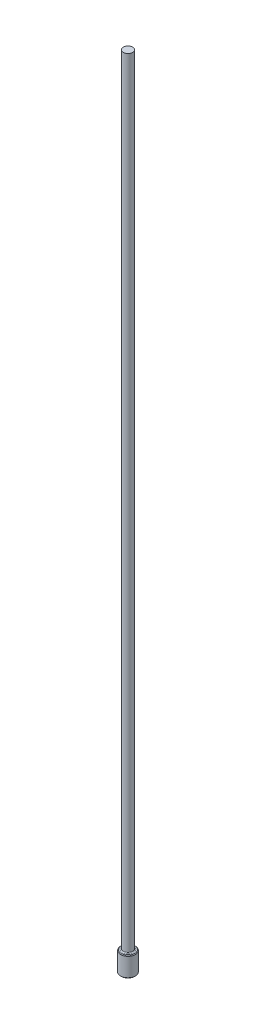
ISO-10303-21;
HEADER;
FILE_DESCRIPTION(('STEP AP214'),'2;1');
FILE_NAME('part.step','',(''),(''),'','','');
FILE_SCHEMA(('AUTOMOTIVE_DESIGN { 1 0 10303 214 1 1 1 1 }'));
ENDSEC;
DATA;
#1=APPLICATION_CONTEXT('core data for automotive mechanical design processes');
#2=APPLICATION_PROTOCOL_DEFINITION('international standard','automotive_design',2000,#1);
#3=PRODUCT_CONTEXT('',#1,'mechanical');
#4=PRODUCT('Part','Part','',(#3));
#5=PRODUCT_RELATED_PRODUCT_CATEGORY('part','',(#4));
#6=PRODUCT_DEFINITION_FORMATION('','',#4);
#7=PRODUCT_DEFINITION_CONTEXT('part definition',#1,'design');
#8=PRODUCT_DEFINITION('design','',#6,#7);
#9=PRODUCT_DEFINITION_SHAPE('','',#8);
#10=(LENGTH_UNIT() NAMED_UNIT(*) SI_UNIT(.MILLI.,.METRE.));
#11=(NAMED_UNIT(*) PLANE_ANGLE_UNIT() SI_UNIT($,.RADIAN.));
#12=(NAMED_UNIT(*) SI_UNIT($,.STERADIAN.) SOLID_ANGLE_UNIT());
#13=UNCERTAINTY_MEASURE_WITH_UNIT(LENGTH_MEASURE(1.E-05),#10,'distance_accuracy_value','');
#14=(GEOMETRIC_REPRESENTATION_CONTEXT(3) GLOBAL_UNCERTAINTY_ASSIGNED_CONTEXT((#13)) GLOBAL_UNIT_ASSIGNED_CONTEXT((#10,
#11,#12)) REPRESENTATION_CONTEXT('',''));
#15=CARTESIAN_POINT('',(0.,0.,0.));
#16=DIRECTION('',(0.,0.,1.));
#17=DIRECTION('',(1.,0.,0.));
#18=AXIS2_PLACEMENT_3D('',#15,#16,#17);
#19=CARTESIAN_POINT('',(0.,0.,0.));
#20=DIRECTION('',(0.,-1.,0.));
#21=DIRECTION('',(0.,0.,-1.));
#22=AXIS2_PLACEMENT_3D('',#19,#20,#21);
#23=PLANE('',#22);
#24=CARTESIAN_POINT('',(0.,0.,0.));
#25=DIRECTION('',(0.,-1.,0.));
#26=DIRECTION('',(0.,0.,-1.));
#27=AXIS2_PLACEMENT_3D('',#24,#25,#26);
#28=CIRCLE('',#27,0.533399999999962);
#29=CARTESIAN_POINT('',(0.,0.,-0.533399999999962));
#30=VERTEX_POINT('',#29);
#31=EDGE_CURVE('E46',#30,#30,#28,.T.);
#32=ORIENTED_EDGE('',*,*,#31,.T.);
#33=EDGE_LOOP('',(#32));
#34=FACE_BOUND('',#33,.T.);
#35=ADVANCED_FACE('F35',(#34),#23,.T.);
#36=CARTESIAN_POINT('',(0.,259.958771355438,0.));
#37=DIRECTION('',(0.,1.,0.));
#38=DIRECTION('',(0.,0.,1.));
#39=AXIS2_PLACEMENT_3D('',#36,#37,#38);
#40=CYLINDRICAL_SURFACE('',#39,0.584199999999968);
#41=CARTESIAN_POINT('',(0.,1.52399999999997,0.));
#42=DIRECTION('',(0.,1.,0.));
#43=DIRECTION('',(0.,0.,1.));
#44=AXIS2_PLACEMENT_3D('',#41,#42,#43);
#45=CIRCLE('',#44,0.584199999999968);
#46=CARTESIAN_POINT('',(0.,1.52399999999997,0.584199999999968));
#47=VERTEX_POINT('',#46);
#48=EDGE_CURVE('E50',#47,#47,#45,.F.);
#49=ORIENTED_EDGE('',*,*,#48,.T.);
#50=EDGE_LOOP('',(#49));
#51=FACE_BOUND('',#50,.T.);
#52=CARTESIAN_POINT('',(0.,0.0508000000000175,0.));
#53=DIRECTION('',(0.,-1.,0.));
#54=DIRECTION('',(0.,0.,-1.));
#55=AXIS2_PLACEMENT_3D('',#52,#53,#54);
#56=CIRCLE('',#55,0.584199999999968);
#57=CARTESIAN_POINT('',(0.,0.0508000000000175,-0.584199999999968));
#58=VERTEX_POINT('',#57);
#59=EDGE_CURVE('E55',#58,#58,#56,.F.);
#60=ORIENTED_EDGE('',*,*,#59,.T.);
#61=EDGE_LOOP('',(#60));
#62=FACE_BOUND('',#61,.T.);
#63=ADVANCED_FACE('F77',(#51,#62),#40,.T.);
#64=CARTESIAN_POINT('',(-0.584199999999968,1.5748,0.));
#65=DIRECTION('',(0.,1.,0.));
#66=DIRECTION('',(0.,0.,1.));
#67=AXIS2_PLACEMENT_3D('',#64,#65,#66);
#68=PLANE('',#67);
#69=CARTESIAN_POINT('',(0.,1.5748,0.));
#70=DIRECTION('',(0.,1.,0.));
#71=DIRECTION('',(0.,0.,1.));
#72=AXIS2_PLACEMENT_3D('',#69,#70,#71);
#73=CIRCLE('',#72,0.444499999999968);
#74=CARTESIAN_POINT('',(0.,1.5748,0.444499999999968));
#75=VERTEX_POINT('',#74);
#76=EDGE_CURVE('E10',#75,#75,#73,.F.);
#77=ORIENTED_EDGE('',*,*,#76,.T.);
#78=EDGE_LOOP('',(#77));
#79=FACE_BOUND('',#78,.T.);
#80=CARTESIAN_POINT('',(0.,1.5748,0.));
#81=DIRECTION('',(0.,1.,0.));
#82=DIRECTION('',(0.,0.,1.));
#83=AXIS2_PLACEMENT_3D('',#80,#81,#82);
#84=CIRCLE('',#83,0.533399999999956);
#85=CARTESIAN_POINT('',(0.,1.5748,0.533399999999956));
#86=VERTEX_POINT('',#85);
#87=EDGE_CURVE('E58',#86,#86,#84,.T.);
#88=ORIENTED_EDGE('',*,*,#87,.T.);
#89=EDGE_LOOP('',(#88));
#90=FACE_BOUND('',#89,.T.);
#91=ADVANCED_FACE('F69',(#79,#90),#68,.T.);
#92=CARTESIAN_POINT('',(0.,259.958771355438,0.));
#93=DIRECTION('',(0.,1.,0.));
#94=DIRECTION('',(0.,0.,1.));
#95=AXIS2_PLACEMENT_3D('',#92,#93,#94);
#96=CYLINDRICAL_SURFACE('',#95,0.368299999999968);
#97=CARTESIAN_POINT('',(0.,1.65100000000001,0.));
#98=DIRECTION('',(0.,1.,0.));
#99=DIRECTION('',(0.,0.,1.));
#100=AXIS2_PLACEMENT_3D('',#97,#98,#99);
#101=CIRCLE('',#100,0.368299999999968);
#102=CARTESIAN_POINT('',(0.,1.65100000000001,0.368299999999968));
#103=VERTEX_POINT('',#102);
#104=EDGE_CURVE('E42',#103,#103,#101,.T.);
#105=ORIENTED_EDGE('',*,*,#104,.T.);
#106=EDGE_LOOP('',(#105));
#107=FACE_BOUND('',#106,.T.);
#108=CARTESIAN_POINT('',(0.,63.5,0.));
#109=DIRECTION('',(0.,1.,0.));
#110=DIRECTION('',(0.,0.,1.));
#111=AXIS2_PLACEMENT_3D('',#108,#109,#110);
#112=CIRCLE('',#111,0.368299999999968);
#113=CARTESIAN_POINT('',(0.,63.5,0.368299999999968));
#114=VERTEX_POINT('',#113);
#115=EDGE_CURVE('E61',#114,#114,#112,.T.);
#116=ORIENTED_EDGE('',*,*,#115,.F.);
#117=EDGE_LOOP('',(#116));
#118=FACE_BOUND('',#117,.T.);
#119=ADVANCED_FACE('F67',(#107,#118),#96,.T.);
#120=CARTESIAN_POINT('',(-0.368299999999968,63.5,0.));
#121=DIRECTION('',(0.,1.,0.));
#122=DIRECTION('',(0.,0.,1.));
#123=AXIS2_PLACEMENT_3D('',#120,#121,#122);
#124=PLANE('',#123);
#125=ORIENTED_EDGE('',*,*,#115,.T.);
#126=EDGE_LOOP('',(#125));
#127=FACE_BOUND('',#126,.T.);
#128=ADVANCED_FACE('F65',(#127),#124,.T.);
#129=CARTESIAN_POINT('',(0.,1.57479999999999,0.));
#130=DIRECTION('',(0.,-1.,0.));
#131=DIRECTION('',(0.,0.,-1.));
#132=AXIS2_PLACEMENT_3D('',#129,#130,#131);
#133=CONICAL_SURFACE('',#132,0.533399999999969,0.785398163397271);
#134=ORIENTED_EDGE('',*,*,#48,.F.);
#135=EDGE_LOOP('',(#134));
#136=FACE_BOUND('',#135,.T.);
#137=ORIENTED_EDGE('',*,*,#87,.F.);
#138=EDGE_LOOP('',(#137));
#139=FACE_BOUND('',#138,.T.);
#140=ADVANCED_FACE('F75',(#136,#139),#133,.T.);
#141=CARTESIAN_POINT('',(0.,0.0508000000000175,0.));
#142=DIRECTION('',(0.,1.,0.));
#143=DIRECTION('',(0.,0.,1.));
#144=AXIS2_PLACEMENT_3D('',#141,#142,#143);
#145=CONICAL_SURFACE('',#144,0.584199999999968,0.785398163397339);
#146=ORIENTED_EDGE('',*,*,#31,.F.);
#147=EDGE_LOOP('',(#146));
#148=FACE_BOUND('',#147,.T.);
#149=ORIENTED_EDGE('',*,*,#59,.F.);
#150=EDGE_LOOP('',(#149));
#151=FACE_BOUND('',#150,.T.);
#152=ADVANCED_FACE('F89',(#148,#151),#145,.T.);
#153=CARTESIAN_POINT('',(0.,1.65100000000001,0.));
#154=DIRECTION('',(0.,1.,0.));
#155=DIRECTION('',(0.,0.,1.));
#156=AXIS2_PLACEMENT_3D('',#153,#154,#155);
#157=TOROIDAL_SURFACE('',#156,0.444499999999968,0.0762);
#158=ORIENTED_EDGE('',*,*,#76,.F.);
#159=EDGE_LOOP('',(#158));
#160=FACE_BOUND('',#159,.T.);
#161=ORIENTED_EDGE('',*,*,#104,.F.);
#162=EDGE_LOOP('',(#161));
#163=FACE_BOUND('',#162,.T.);
#164=ADVANCED_FACE('F37',(#160,#163),#157,.F.);
#165=CLOSED_SHELL('',(#35,#63,#91,#119,#128,#140,#152,#164));
#166=MANIFOLD_SOLID_BREP('B2',#165);
#167=ADVANCED_BREP_SHAPE_REPRESENTATION('',(#18,#166),#14);
#168=SHAPE_DEFINITION_REPRESENTATION(#9,#167);
ENDSEC;
END-ISO-10303-21;
